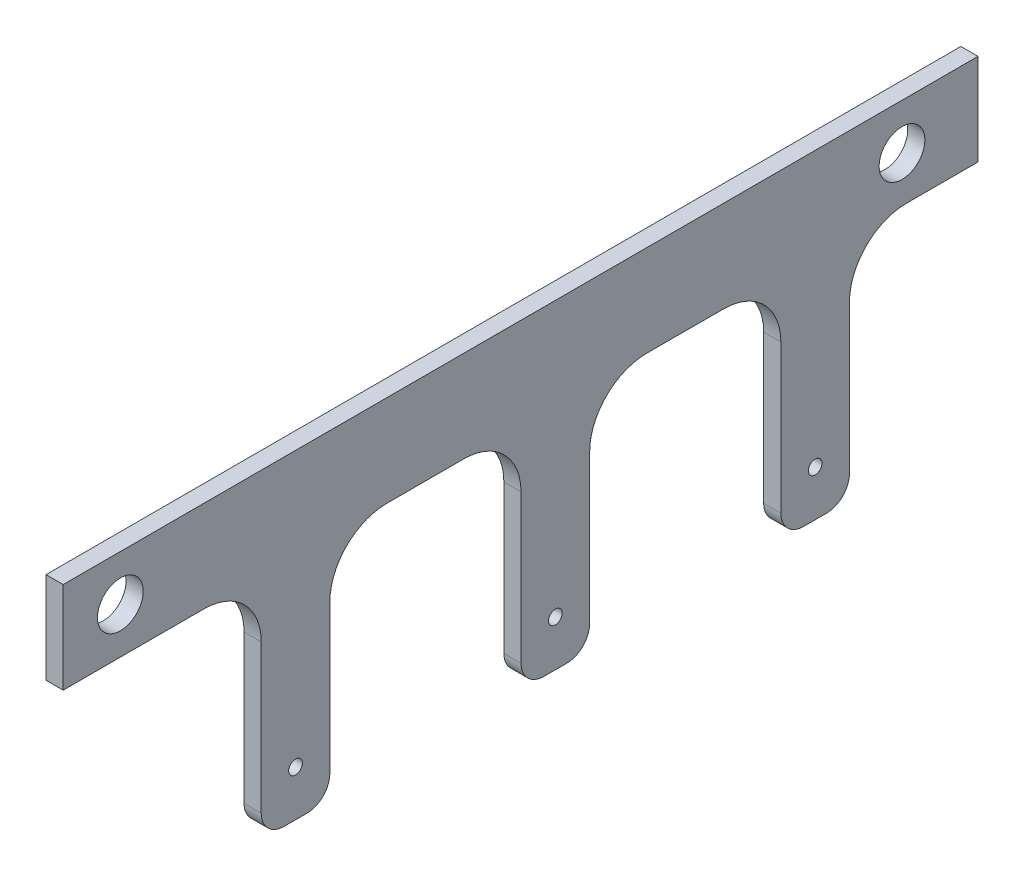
from build123d import *

# Parameters (mm, degrees)
SKETCH2_R           = 1.905
BOSS_EXTRUDE1_DEPTH = 4.7625
SKETCH3_R           = 6.35
CUT_EXTRUDE1_DEPTH  = 146.974519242
LPATTERN1_COUNT     = 2
LPATTERN1_PITCH     = 217.023901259
FILLET1_R           = 15.875
FILLET2_R           = 6.35


with BuildPart() as part:
    # Sketch2 → Boss-Extrude1 (new body)
    with BuildSketch(Plane(origin=(0, 0, 0), x_dir=(0, 0, -1), z_dir=(1, 0, 0))):
        Polygon((-128.509816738, -5.643957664), (-73.520436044, -5.643957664), (-73.520436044, -69.073192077), (-54.470436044, -69.073192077), (-54.470436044, -5.643957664), (-1.387131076, -5.643957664), (-1.387131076, -69.073192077), (17.662868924, -69.073192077), (17.662868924, -5.643957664), (70.746173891, -5.643957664), (70.746173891, -69.073192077), (89.796173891, -69.073192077), (89.796173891, -5.643957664), (125.490183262, -5.643957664), (125.490183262, 19.756042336), (-128.509816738, 19.756042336), align=None)
        with Locations(Location((-63.995436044, -56.373192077, 0), (0, 0, 180))):
            Circle(SKETCH2_R, mode=Mode.SUBTRACT)
        with Locations(Location((8.137868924, -56.373192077, 0), (0, 0, 180))):
            Circle(SKETCH2_R, mode=Mode.SUBTRACT)
        with Locations(Location((80.271173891, -56.373192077, 0), (0, 0, 180))):
            Circle(SKETCH2_R, mode=Mode.SUBTRACT)
    extrude(amount=BOSS_EXTRUDE1_DEPTH)

    # Sketch3 → Cut-Extrude1 (cut, through all)
    with BuildSketch(Plane(origin=(4.7625, 0, 0), x_dir=(0, 0, -1), z_dir=(1, 0, 0))):
        with Locations((-112.634816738, 7.056042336)):
            Circle(SKETCH3_R)
    cut_extrude1 = extrude(amount=-CUT_EXTRUDE1_DEPTH, mode=Mode.SUBTRACT)

    # LPattern1: Cut-Extrude1 ×2
    with Locations(*[(0, 0, -i * LPATTERN1_PITCH) for i in range(1, LPATTERN1_COUNT)]):
        add(cut_extrude1, mode=Mode.SUBTRACT)

    # Fillet1
    fillet1_edges = [part.edges().sort_by_distance(p)[0] for p in [
        (2.38125, -5.643957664, -89.796173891),
        (2.38125, -5.643957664, -70.746173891),
        (2.38125, -5.643957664, -17.662868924),
        (2.38125, -5.643957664, 1.387131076),
        (2.38125, -5.643957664, 54.470436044),
        (2.38125, -5.643957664, 73.520436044),
    ]]
    fillet(fillet1_edges, radius=FILLET1_R)

    # Fillet2
    fillet2_edges = [part.edges().sort_by_distance(p)[0] for p in [
        (2.38125, -69.073192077, -89.796173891),
        (2.38125, -69.073192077, -70.746173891),
        (2.38125, -69.073192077, -17.662868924),
        (2.38125, -69.073192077, 1.387131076),
        (2.38125, -69.073192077, 54.470436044),
        (2.38125, -69.073192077, 73.520436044),
    ]]
    fillet(fillet2_edges, radius=FILLET2_R)


solid = part.part
